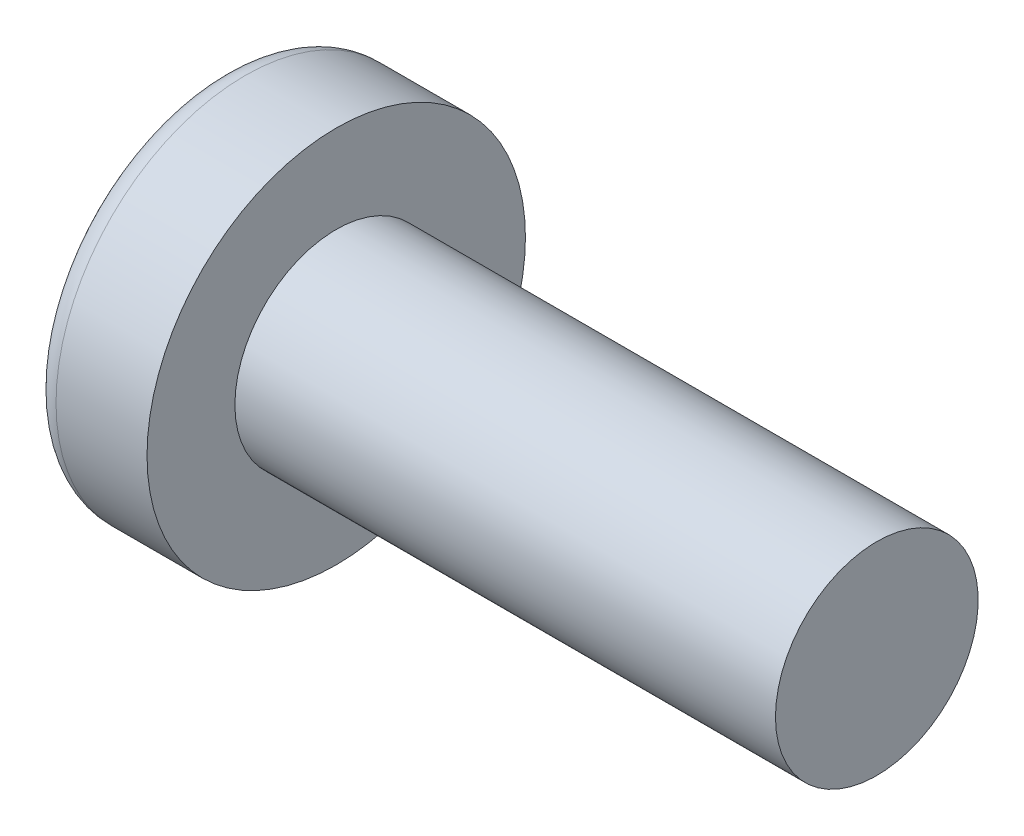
ISO-10303-21;
HEADER;
FILE_DESCRIPTION(('STEP AP214'),'2;1');
FILE_NAME('part.step','',(''),(''),'','','');
FILE_SCHEMA(('AUTOMOTIVE_DESIGN { 1 0 10303 214 1 1 1 1 }'));
ENDSEC;
DATA;
#1=APPLICATION_CONTEXT('core data for automotive mechanical design processes');
#2=APPLICATION_PROTOCOL_DEFINITION('international standard','automotive_design',2000,#1);
#3=PRODUCT_CONTEXT('',#1,'mechanical');
#4=PRODUCT('Part','Part','',(#3));
#5=PRODUCT_RELATED_PRODUCT_CATEGORY('part','',(#4));
#6=PRODUCT_DEFINITION_FORMATION('','',#4);
#7=PRODUCT_DEFINITION_CONTEXT('part definition',#1,'design');
#8=PRODUCT_DEFINITION('design','',#6,#7);
#9=PRODUCT_DEFINITION_SHAPE('','',#8);
#10=(LENGTH_UNIT() NAMED_UNIT(*) SI_UNIT(.MILLI.,.METRE.));
#11=(NAMED_UNIT(*) PLANE_ANGLE_UNIT() SI_UNIT($,.RADIAN.));
#12=(NAMED_UNIT(*) SI_UNIT($,.STERADIAN.) SOLID_ANGLE_UNIT());
#13=UNCERTAINTY_MEASURE_WITH_UNIT(LENGTH_MEASURE(1.E-05),#10,'distance_accuracy_value','');
#14=(GEOMETRIC_REPRESENTATION_CONTEXT(3) GLOBAL_UNCERTAINTY_ASSIGNED_CONTEXT((#13)) GLOBAL_UNIT_ASSIGNED_CONTEXT((#10,
#11,#12)) REPRESENTATION_CONTEXT('',''));
#15=CARTESIAN_POINT('',(0.,0.,0.));
#16=DIRECTION('',(0.,0.,1.));
#17=DIRECTION('',(1.,0.,0.));
#18=AXIS2_PLACEMENT_3D('',#15,#16,#17);
#19=CARTESIAN_POINT('',(5.,0.,0.));
#20=DIRECTION('',(-1.,0.,0.));
#21=DIRECTION('',(0.,1.,0.));
#22=AXIS2_PLACEMENT_3D('',#19,#20,#21);
#23=SPHERICAL_SURFACE('',#22,5.);
#24=CARTESIAN_POINT('',(0.74715070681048,0.,0.));
#25=DIRECTION('',(-1.,0.,0.));
#26=DIRECTION('',(0.,0.,1.));
#27=AXIS2_PLACEMENT_3D('',#24,#25,#26);
#28=CIRCLE('',#27,2.62931034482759);
#29=CARTESIAN_POINT('',(0.74715070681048,0.,2.62931034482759));
#30=VERTEX_POINT('',#29);
#31=EDGE_CURVE('E152',#30,#30,#28,.T.);
#32=ORIENTED_EDGE('',*,*,#31,.T.);
#33=EDGE_LOOP('',(#32));
#34=FACE_BOUND('',#33,.T.);
#35=CARTESIAN_POINT('',(4.98382636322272,-0.153868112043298,0.));
#36=DIRECTION('',(-0.104537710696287,-0.994520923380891,0.));
#37=DIRECTION('',(0.994520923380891,-0.104537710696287,0.));
#38=AXIS2_PLACEMENT_3D('',#35,#36,#37);
#39=CIRCLE('',#38,4.99760572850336);
#40=CARTESIAN_POINT('',(0.188596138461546,0.350175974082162,1.31444652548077));
#41=VERTEX_POINT('',#40);
#42=CARTESIAN_POINT('',(0.0270341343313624,0.367158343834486,0.367158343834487));
#43=VERTEX_POINT('',#42);
#44=EDGE_CURVE('E183',#41,#43,#39,.T.);
#45=ORIENTED_EDGE('',*,*,#44,.F.);
#46=CARTESIAN_POINT('',(3.98403090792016,0.,-1.41352221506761));
#47=DIRECTION('',(0.583636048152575,0.,0.812015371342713));
#48=DIRECTION('',(0.812015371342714,0.,-0.583636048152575));
#49=AXIS2_PLACEMENT_3D('',#46,#47,#48);
#50=CIRCLE('',#49,4.68719124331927);
#51=CARTESIAN_POINT('',(0.188596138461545,-0.350175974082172,1.31444652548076));
#52=VERTEX_POINT('',#51);
#53=EDGE_CURVE('E148',#41,#52,#50,.T.);
#54=ORIENTED_EDGE('',*,*,#53,.T.);
#55=CARTESIAN_POINT('',(4.98382636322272,0.153868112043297,0.));
#56=DIRECTION('',(-0.104537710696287,0.994520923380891,0.));
#57=DIRECTION('',(-0.994520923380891,-0.104537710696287,0.));
#58=AXIS2_PLACEMENT_3D('',#55,#56,#57);
#59=CIRCLE('',#58,4.99760572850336);
#60=CARTESIAN_POINT('',(0.0270341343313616,-0.367158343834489,0.367158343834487));
#61=VERTEX_POINT('',#60);
#62=EDGE_CURVE('E104',#61,#52,#59,.T.);
#63=ORIENTED_EDGE('',*,*,#62,.F.);
#64=CARTESIAN_POINT('',(4.98382636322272,0.,-0.153868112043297));
#65=DIRECTION('',(-0.104537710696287,0.,-0.994520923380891));
#66=DIRECTION('',(-0.994520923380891,0.,0.104537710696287));
#67=AXIS2_PLACEMENT_3D('',#64,#65,#66);
#68=CIRCLE('',#67,4.99760572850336);
#69=CARTESIAN_POINT('',(0.188596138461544,-1.31444652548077,0.350175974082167));
#70=VERTEX_POINT('',#69);
#71=EDGE_CURVE('E129',#70,#61,#68,.T.);
#72=ORIENTED_EDGE('',*,*,#71,.F.);
#73=CARTESIAN_POINT('',(3.98403090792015,1.41352221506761,0.));
#74=DIRECTION('',(0.583636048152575,-0.812015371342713,0.));
#75=DIRECTION('',(0.812015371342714,0.583636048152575,0.));
#76=AXIS2_PLACEMENT_3D('',#73,#74,#75);
#77=CIRCLE('',#76,4.68719124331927);
#78=CARTESIAN_POINT('',(0.188596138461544,-1.31444652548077,-0.350175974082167));
#79=VERTEX_POINT('',#78);
#80=EDGE_CURVE('E137',#70,#79,#77,.T.);
#81=ORIENTED_EDGE('',*,*,#80,.T.);
#82=CARTESIAN_POINT('',(4.98382636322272,0.,0.153868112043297));
#83=DIRECTION('',(-0.104537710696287,0.,0.994520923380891));
#84=DIRECTION('',(0.994520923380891,0.,0.104537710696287));
#85=AXIS2_PLACEMENT_3D('',#82,#83,#84);
#86=CIRCLE('',#85,4.99760572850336);
#87=CARTESIAN_POINT('',(0.0270341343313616,-0.367158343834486,-0.367158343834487));
#88=VERTEX_POINT('',#87);
#89=EDGE_CURVE('E47',#88,#79,#86,.T.);
#90=ORIENTED_EDGE('',*,*,#89,.F.);
#91=CARTESIAN_POINT('',(0.188596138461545,-0.350175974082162,-1.31444652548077));
#92=VERTEX_POINT('',#91);
#93=EDGE_CURVE('E190',#92,#88,#59,.T.);
#94=ORIENTED_EDGE('',*,*,#93,.F.);
#95=CARTESIAN_POINT('',(3.98403090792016,0.,1.41352221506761));
#96=DIRECTION('',(0.583636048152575,0.,-0.812015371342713));
#97=DIRECTION('',(-0.812015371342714,0.,-0.583636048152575));
#98=AXIS2_PLACEMENT_3D('',#95,#96,#97);
#99=CIRCLE('',#98,4.68719124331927);
#100=CARTESIAN_POINT('',(0.188596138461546,0.350175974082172,-1.31444652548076));
#101=VERTEX_POINT('',#100);
#102=EDGE_CURVE('E130',#92,#101,#99,.T.);
#103=ORIENTED_EDGE('',*,*,#102,.T.);
#104=CARTESIAN_POINT('',(0.0270341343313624,0.367158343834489,-0.367158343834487));
#105=VERTEX_POINT('',#104);
#106=EDGE_CURVE('E178',#105,#101,#39,.T.);
#107=ORIENTED_EDGE('',*,*,#106,.F.);
#108=CARTESIAN_POINT('',(0.188596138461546,1.31444652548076,-0.350175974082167));
#109=VERTEX_POINT('',#108);
#110=EDGE_CURVE('E40',#109,#105,#86,.T.);
#111=ORIENTED_EDGE('',*,*,#110,.F.);
#112=CARTESIAN_POINT('',(3.98403090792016,-1.41352221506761,0.));
#113=DIRECTION('',(0.583636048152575,0.812015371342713,0.));
#114=DIRECTION('',(-0.812015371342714,0.583636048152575,0.));
#115=AXIS2_PLACEMENT_3D('',#112,#113,#114);
#116=CIRCLE('',#115,4.68719124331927);
#117=CARTESIAN_POINT('',(0.188596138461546,1.31444652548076,0.350175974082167));
#118=VERTEX_POINT('',#117);
#119=EDGE_CURVE('E11',#109,#118,#116,.T.);
#120=ORIENTED_EDGE('',*,*,#119,.T.);
#121=EDGE_CURVE('E166',#43,#118,#68,.T.);
#122=ORIENTED_EDGE('',*,*,#121,.F.);
#123=EDGE_LOOP('',(#45,#54,#63,#72,#81,#90,#94,#103,#107,#111,#120,#122));
#124=FACE_BOUND('',#123,.T.);
#125=ADVANCED_FACE('F32',(#34,#124),#23,.T.);
#126=CARTESIAN_POINT('',(2.01739130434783,0.,-0.15794466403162));
#127=DIRECTION('',(-0.104537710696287,0.,0.994520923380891));
#128=DIRECTION('',(0.994520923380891,0.,0.104537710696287));
#129=AXIS2_PLACEMENT_3D('',#126,#127,#128);
#130=PLANE('',#129);
#131=ORIENTED_EDGE('',*,*,#110,.T.);
#132=DIRECTION('',(0.989130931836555,-0.103971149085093,0.103971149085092));
#133=VECTOR('',#132,1.);
#134=CARTESIAN_POINT('',(2.03363450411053,0.156237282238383,-0.156237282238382));
#135=LINE('',#134,#133);
#136=CARTESIAN_POINT('',(1.76,0.185000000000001,-0.184999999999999));
#137=VERTEX_POINT('',#136);
#138=EDGE_CURVE('E172',#105,#137,#135,.T.);
#139=ORIENTED_EDGE('',*,*,#138,.T.);
#140=DIRECTION('',(0.80907355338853,-0.581521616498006,0.0850446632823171));
#141=VECTOR('',#140,1.);
#142=CARTESIAN_POINT('',(0.,1.45,-0.37));
#143=LINE('',#142,#141);
#144=EDGE_CURVE('E153',#109,#137,#143,.T.);
#145=ORIENTED_EDGE('',*,*,#144,.F.);
#146=EDGE_LOOP('',(#131,#139,#145));
#147=FACE_BOUND('',#146,.T.);
#148=ADVANCED_FACE('F171',(#147),#130,.T.);
#149=DIRECTION('',(0.80907355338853,0.581521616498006,0.0850446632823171));
#150=VECTOR('',#149,1.);
#151=CARTESIAN_POINT('',(0.,-1.45,-0.37));
#152=LINE('',#151,#150);
#153=CARTESIAN_POINT('',(1.76,-0.185,-0.185));
#154=VERTEX_POINT('',#153);
#155=EDGE_CURVE('E138',#79,#154,#152,.T.);
#156=ORIENTED_EDGE('',*,*,#155,.T.);
#157=DIRECTION('',(-0.989130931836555,-0.103971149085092,-0.103971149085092));
#158=VECTOR('',#157,1.);
#159=CARTESIAN_POINT('',(2.03363450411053,-0.156237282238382,-0.156237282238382));
#160=LINE('',#159,#158);
#161=EDGE_CURVE('E193',#154,#88,#160,.T.);
#162=ORIENTED_EDGE('',*,*,#161,.T.);
#163=ORIENTED_EDGE('',*,*,#89,.T.);
#164=EDGE_LOOP('',(#156,#162,#163));
#165=FACE_BOUND('',#164,.T.);
#166=ADVANCED_FACE('F208',(#165),#130,.T.);
#167=CARTESIAN_POINT('',(2.01739130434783,0.,0.157944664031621));
#168=DIRECTION('',(-0.104537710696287,0.,-0.994520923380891));
#169=DIRECTION('',(-0.994520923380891,0.,0.104537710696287));
#170=AXIS2_PLACEMENT_3D('',#167,#168,#169);
#171=PLANE('',#170);
#172=DIRECTION('',(0.80907355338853,-0.581521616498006,-0.085044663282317));
#173=VECTOR('',#172,1.);
#174=CARTESIAN_POINT('',(0.,1.45,0.37));
#175=LINE('',#174,#173);
#176=CARTESIAN_POINT('',(1.76,0.185,0.185));
#177=VERTEX_POINT('',#176);
#178=EDGE_CURVE('E209',#118,#177,#175,.T.);
#179=ORIENTED_EDGE('',*,*,#178,.T.);
#180=DIRECTION('',(-0.989130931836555,0.103971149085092,0.103971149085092));
#181=VECTOR('',#180,1.);
#182=CARTESIAN_POINT('',(2.03363450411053,0.156237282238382,0.156237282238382));
#183=LINE('',#182,#181);
#184=EDGE_CURVE('E187',#177,#43,#183,.T.);
#185=ORIENTED_EDGE('',*,*,#184,.T.);
#186=ORIENTED_EDGE('',*,*,#121,.T.);
#187=EDGE_LOOP('',(#179,#185,#186));
#188=FACE_BOUND('',#187,.T.);
#189=ADVANCED_FACE('F213',(#188),#171,.T.);
#190=ORIENTED_EDGE('',*,*,#71,.T.);
#191=DIRECTION('',(0.989130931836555,0.103971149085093,-0.103971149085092));
#192=VECTOR('',#191,1.);
#193=CARTESIAN_POINT('',(2.03363450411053,-0.156237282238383,0.156237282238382));
#194=LINE('',#193,#192);
#195=CARTESIAN_POINT('',(1.76,-0.185000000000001,0.184999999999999));
#196=VERTEX_POINT('',#195);
#197=EDGE_CURVE('E102',#61,#196,#194,.T.);
#198=ORIENTED_EDGE('',*,*,#197,.T.);
#199=DIRECTION('',(0.80907355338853,0.581521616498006,-0.0850446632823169));
#200=VECTOR('',#199,1.);
#201=CARTESIAN_POINT('',(0.,-1.45,0.37));
#202=LINE('',#201,#200);
#203=EDGE_CURVE('E127',#70,#196,#202,.T.);
#204=ORIENTED_EDGE('',*,*,#203,.F.);
#205=EDGE_LOOP('',(#190,#198,#204));
#206=FACE_BOUND('',#205,.T.);
#207=ADVANCED_FACE('F126',(#206),#171,.T.);
#208=CARTESIAN_POINT('',(-25.4,0.,0.));
#209=DIRECTION('',(-1.,0.,0.));
#210=DIRECTION('',(0.,0.,1.));
#211=AXIS2_PLACEMENT_3D('',#208,#209,#210);
#212=CYLINDRICAL_SURFACE('',#211,1.5);
#213=CARTESIAN_POINT('',(10.4,0.,0.));
#214=DIRECTION('',(-1.,0.,0.));
#215=DIRECTION('',(0.,0.,1.));
#216=AXIS2_PLACEMENT_3D('',#213,#214,#215);
#217=CIRCLE('',#216,1.5);
#218=CARTESIAN_POINT('',(10.4,0.,1.5));
#219=VERTEX_POINT('',#218);
#220=EDGE_CURVE('E149',#219,#219,#217,.T.);
#221=ORIENTED_EDGE('',*,*,#220,.T.);
#222=EDGE_LOOP('',(#221));
#223=FACE_BOUND('',#222,.T.);
#224=CARTESIAN_POINT('',(2.4,0.,0.));
#225=DIRECTION('',(-1.,0.,0.));
#226=DIRECTION('',(0.,0.,1.));
#227=AXIS2_PLACEMENT_3D('',#224,#225,#226);
#228=CIRCLE('',#227,1.5);
#229=CARTESIAN_POINT('',(2.4,0.,1.5));
#230=VERTEX_POINT('',#229);
#231=EDGE_CURVE('E162',#230,#230,#228,.T.);
#232=ORIENTED_EDGE('',*,*,#231,.F.);
#233=EDGE_LOOP('',(#232));
#234=FACE_BOUND('',#233,.T.);
#235=ADVANCED_FACE('F34',(#223,#234),#212,.T.);
#236=CARTESIAN_POINT('',(2.4,1.5,0.));
#237=DIRECTION('',(-1.,0.,0.));
#238=DIRECTION('',(0.,0.,1.));
#239=AXIS2_PLACEMENT_3D('',#236,#237,#238);
#240=PLANE('',#239);
#241=CARTESIAN_POINT('',(2.4,0.,0.));
#242=DIRECTION('',(-1.,0.,0.));
#243=DIRECTION('',(0.,0.,1.));
#244=AXIS2_PLACEMENT_3D('',#241,#242,#243);
#245=CIRCLE('',#244,2.8);
#246=CARTESIAN_POINT('',(2.4,0.,2.8));
#247=VERTEX_POINT('',#246);
#248=EDGE_CURVE('E159',#247,#247,#245,.T.);
#249=ORIENTED_EDGE('',*,*,#248,.F.);
#250=EDGE_LOOP('',(#249));
#251=FACE_BOUND('',#250,.T.);
#252=ORIENTED_EDGE('',*,*,#231,.T.);
#253=EDGE_LOOP('',(#252));
#254=FACE_BOUND('',#253,.T.);
#255=ADVANCED_FACE('F241',(#251,#254),#240,.F.);
#256=CARTESIAN_POINT('',(-25.4,0.,0.));
#257=DIRECTION('',(-1.,0.,0.));
#258=DIRECTION('',(0.,0.,1.));
#259=AXIS2_PLACEMENT_3D('',#256,#257,#258);
#260=CYLINDRICAL_SURFACE('',#259,2.8);
#261=ORIENTED_EDGE('',*,*,#248,.T.);
#262=EDGE_LOOP('',(#261));
#263=FACE_BOUND('',#262,.T.);
#264=CARTESIAN_POINT('',(1.05335585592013,0.,0.));
#265=DIRECTION('',(-1.,0.,0.));
#266=DIRECTION('',(0.,0.,1.));
#267=AXIS2_PLACEMENT_3D('',#264,#265,#266);
#268=CIRCLE('',#267,2.8);
#269=CARTESIAN_POINT('',(1.05335585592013,0.,2.8));
#270=VERTEX_POINT('',#269);
#271=EDGE_CURVE('E156',#270,#270,#268,.T.);
#272=ORIENTED_EDGE('',*,*,#271,.F.);
#273=EDGE_LOOP('',(#272));
#274=FACE_BOUND('',#273,.T.);
#275=ADVANCED_FACE('F238',(#263,#274),#260,.T.);
#276=CARTESIAN_POINT('',(1.05335585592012,0.,0.));
#277=DIRECTION('',(-1.,0.,0.));
#278=DIRECTION('',(0.,0.,1.));
#279=AXIS2_PLACEMENT_3D('',#276,#277,#278);
#280=TOROIDAL_SURFACE('',#279,2.44,0.36);
#281=ORIENTED_EDGE('',*,*,#271,.T.);
#282=EDGE_LOOP('',(#281));
#283=FACE_BOUND('',#282,.T.);
#284=ORIENTED_EDGE('',*,*,#31,.F.);
#285=EDGE_LOOP('',(#284));
#286=FACE_BOUND('',#285,.T.);
#287=ADVANCED_FACE('F235',(#283,#286),#280,.T.);
#288=CARTESIAN_POINT('',(10.4,1.5,0.));
#289=DIRECTION('',(1.,0.,0.));
#290=DIRECTION('',(0.,0.,-1.));
#291=AXIS2_PLACEMENT_3D('',#288,#289,#290);
#292=PLANE('',#291);
#293=ORIENTED_EDGE('',*,*,#220,.F.);
#294=EDGE_LOOP('',(#293));
#295=FACE_BOUND('',#294,.T.);
#296=ADVANCED_FACE('F233',(#295),#292,.T.);
#297=CARTESIAN_POINT('',(1.76,0.185,0.185));
#298=DIRECTION('',(0.583636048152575,0.812015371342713,0.));
#299=DIRECTION('',(-0.812015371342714,0.583636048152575,0.));
#300=AXIS2_PLACEMENT_3D('',#297,#298,#299);
#301=PLANE('',#300);
#302=ORIENTED_EDGE('',*,*,#144,.T.);
#303=DIRECTION('',(0.,0.,-1.));
#304=VECTOR('',#303,1.);
#305=CARTESIAN_POINT('',(1.76,0.185,0.185));
#306=LINE('',#305,#304);
#307=EDGE_CURVE('E120',#177,#137,#306,.T.);
#308=ORIENTED_EDGE('',*,*,#307,.F.);
#309=ORIENTED_EDGE('',*,*,#178,.F.);
#310=ORIENTED_EDGE('',*,*,#119,.F.);
#311=EDGE_LOOP('',(#302,#308,#309,#310));
#312=FACE_BOUND('',#311,.T.);
#313=ADVANCED_FACE('F212',(#312),#301,.F.);
#314=CARTESIAN_POINT('',(1.76,-0.185,-0.185));
#315=DIRECTION('',(0.583636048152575,-0.812015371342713,0.));
#316=DIRECTION('',(0.812015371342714,0.583636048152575,0.));
#317=AXIS2_PLACEMENT_3D('',#314,#315,#316);
#318=PLANE('',#317);
#319=ORIENTED_EDGE('',*,*,#203,.T.);
#320=DIRECTION('',(0.,0.,1.));
#321=VECTOR('',#320,1.);
#322=CARTESIAN_POINT('',(1.76,-0.185,-0.185));
#323=LINE('',#322,#321);
#324=EDGE_CURVE('E119',#154,#196,#323,.T.);
#325=ORIENTED_EDGE('',*,*,#324,.F.);
#326=ORIENTED_EDGE('',*,*,#155,.F.);
#327=ORIENTED_EDGE('',*,*,#80,.F.);
#328=EDGE_LOOP('',(#319,#325,#326,#327));
#329=FACE_BOUND('',#328,.T.);
#330=ADVANCED_FACE('F134',(#329),#318,.F.);
#331=CARTESIAN_POINT('',(1.76,-0.185,-0.185));
#332=DIRECTION('',(1.,0.,0.));
#333=DIRECTION('',(0.,0.,-1.));
#334=AXIS2_PLACEMENT_3D('',#331,#332,#333);
#335=PLANE('',#334);
#336=DIRECTION('',(0.,1.,0.));
#337=VECTOR('',#336,1.);
#338=CARTESIAN_POINT('',(1.76,-0.185,-0.185));
#339=LINE('',#338,#337);
#340=EDGE_CURVE('E142',#154,#137,#339,.T.);
#341=ORIENTED_EDGE('',*,*,#340,.F.);
#342=ORIENTED_EDGE('',*,*,#324,.T.);
#343=DIRECTION('',(0.,-1.,0.));
#344=VECTOR('',#343,1.);
#345=CARTESIAN_POINT('',(1.76,0.185,0.185));
#346=LINE('',#345,#344);
#347=EDGE_CURVE('E111',#177,#196,#346,.T.);
#348=ORIENTED_EDGE('',*,*,#347,.F.);
#349=ORIENTED_EDGE('',*,*,#307,.T.);
#350=EDGE_LOOP('',(#341,#342,#348,#349));
#351=FACE_BOUND('',#350,.T.);
#352=ADVANCED_FACE('F140',(#351),#335,.F.);
#353=CARTESIAN_POINT('',(1.76,0.185000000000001,-0.184999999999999));
#354=DIRECTION('',(0.583636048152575,0.,-0.812015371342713));
#355=DIRECTION('',(0.812015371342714,0.,0.583636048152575));
#356=AXIS2_PLACEMENT_3D('',#353,#354,#355);
#357=PLANE('',#356);
#358=DIRECTION('',(0.80907355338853,0.0850446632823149,0.581521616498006));
#359=VECTOR('',#358,1.);
#360=CARTESIAN_POINT('',(0.,-0.369999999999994,-1.45));
#361=LINE('',#360,#359);
#362=EDGE_CURVE('E198',#92,#154,#361,.T.);
#363=ORIENTED_EDGE('',*,*,#362,.T.);
#364=ORIENTED_EDGE('',*,*,#340,.T.);
#365=DIRECTION('',(0.80907355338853,-0.0850446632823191,0.581521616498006));
#366=VECTOR('',#365,1.);
#367=CARTESIAN_POINT('',(0.,0.370000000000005,-1.45));
#368=LINE('',#367,#366);
#369=EDGE_CURVE('E108',#101,#137,#368,.T.);
#370=ORIENTED_EDGE('',*,*,#369,.F.);
#371=ORIENTED_EDGE('',*,*,#102,.F.);
#372=EDGE_LOOP('',(#363,#364,#370,#371));
#373=FACE_BOUND('',#372,.T.);
#374=ADVANCED_FACE('F203',(#373),#357,.F.);
#375=CARTESIAN_POINT('',(2.01739130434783,-0.157944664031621,0.));
#376=DIRECTION('',(-0.104537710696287,0.994520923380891,0.));
#377=DIRECTION('',(-0.994520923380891,-0.104537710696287,0.));
#378=AXIS2_PLACEMENT_3D('',#375,#376,#377);
#379=PLANE('',#378);
#380=ORIENTED_EDGE('',*,*,#93,.T.);
#381=ORIENTED_EDGE('',*,*,#161,.F.);
#382=ORIENTED_EDGE('',*,*,#362,.F.);
#383=EDGE_LOOP('',(#380,#381,#382));
#384=FACE_BOUND('',#383,.T.);
#385=ADVANCED_FACE('F207',(#384),#379,.T.);
#386=CARTESIAN_POINT('',(2.01739130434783,0.15794466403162,0.));
#387=DIRECTION('',(-0.104537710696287,-0.994520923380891,0.));
#388=DIRECTION('',(0.994520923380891,-0.104537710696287,0.));
#389=AXIS2_PLACEMENT_3D('',#386,#387,#388);
#390=PLANE('',#389);
#391=ORIENTED_EDGE('',*,*,#106,.T.);
#392=ORIENTED_EDGE('',*,*,#369,.T.);
#393=ORIENTED_EDGE('',*,*,#138,.F.);
#394=EDGE_LOOP('',(#391,#392,#393));
#395=FACE_BOUND('',#394,.T.);
#396=ADVANCED_FACE('F201',(#395),#390,.T.);
#397=CARTESIAN_POINT('',(1.76,-0.185000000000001,0.184999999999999));
#398=DIRECTION('',(0.583636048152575,0.,0.812015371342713));
#399=DIRECTION('',(-0.812015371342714,0.,0.583636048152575));
#400=AXIS2_PLACEMENT_3D('',#397,#398,#399);
#401=PLANE('',#400);
#402=DIRECTION('',(0.80907355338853,-0.0850446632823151,-0.581521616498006));
#403=VECTOR('',#402,1.);
#404=CARTESIAN_POINT('',(0.,0.369999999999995,1.45));
#405=LINE('',#404,#403);
#406=EDGE_CURVE('E107',#41,#177,#405,.T.);
#407=ORIENTED_EDGE('',*,*,#406,.T.);
#408=ORIENTED_EDGE('',*,*,#347,.T.);
#409=DIRECTION('',(0.80907355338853,0.085044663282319,-0.581521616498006));
#410=VECTOR('',#409,1.);
#411=CARTESIAN_POINT('',(0.,-0.370000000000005,1.45));
#412=LINE('',#411,#410);
#413=EDGE_CURVE('E98',#52,#196,#412,.T.);
#414=ORIENTED_EDGE('',*,*,#413,.F.);
#415=ORIENTED_EDGE('',*,*,#53,.F.);
#416=EDGE_LOOP('',(#407,#408,#414,#415));
#417=FACE_BOUND('',#416,.T.);
#418=ADVANCED_FACE('F112',(#417),#401,.F.);
#419=ORIENTED_EDGE('',*,*,#44,.T.);
#420=ORIENTED_EDGE('',*,*,#184,.F.);
#421=ORIENTED_EDGE('',*,*,#406,.F.);
#422=EDGE_LOOP('',(#419,#420,#421));
#423=FACE_BOUND('',#422,.T.);
#424=ADVANCED_FACE('F214',(#423),#390,.T.);
#425=ORIENTED_EDGE('',*,*,#62,.T.);
#426=ORIENTED_EDGE('',*,*,#413,.T.);
#427=ORIENTED_EDGE('',*,*,#197,.F.);
#428=EDGE_LOOP('',(#425,#426,#427));
#429=FACE_BOUND('',#428,.T.);
#430=ADVANCED_FACE('F100',(#429),#379,.T.);
#431=CLOSED_SHELL('',(#125,#148,#166,#189,#207,#235,#255,#275,#287,#296,#313,#330,#352,#374,
#385,#396,#418,#424,#430));
#432=MANIFOLD_SOLID_BREP('B2',#431);
#433=ADVANCED_BREP_SHAPE_REPRESENTATION('',(#18,#432),#14);
#434=SHAPE_DEFINITION_REPRESENTATION(#9,#433);
ENDSEC;
END-ISO-10303-21;
